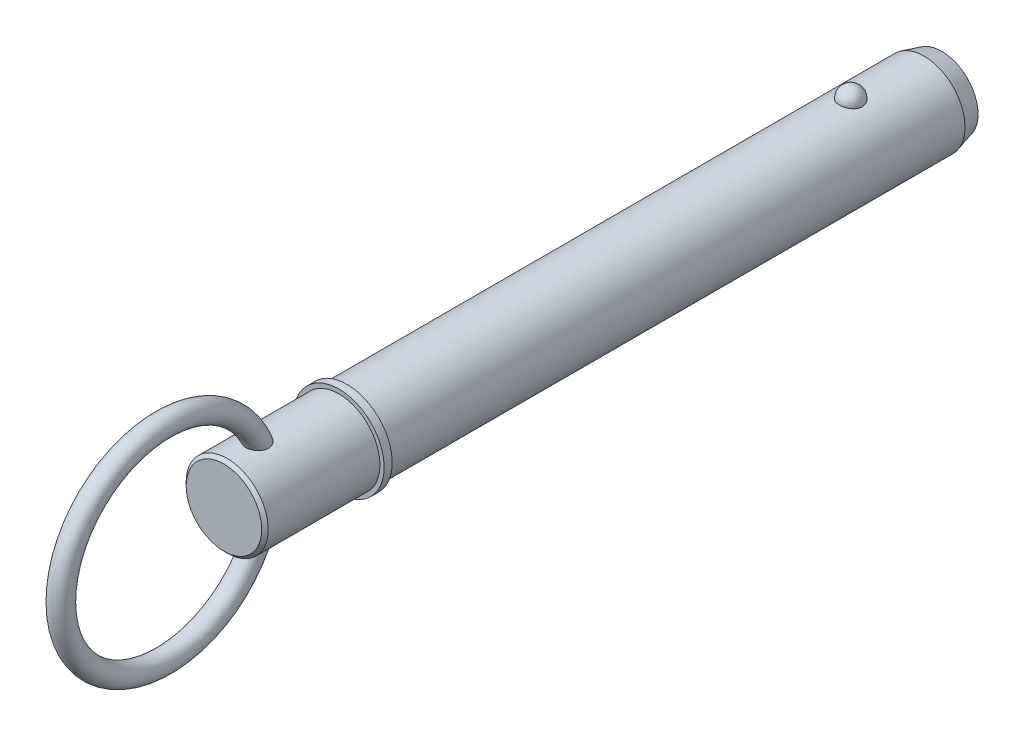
ISO-10303-21;
HEADER;
FILE_DESCRIPTION(('STEP AP214'),'2;1');
FILE_NAME('part.step','',(''),(''),'','','');
FILE_SCHEMA(('AUTOMOTIVE_DESIGN { 1 0 10303 214 1 1 1 1 }'));
ENDSEC;
DATA;
#1=APPLICATION_CONTEXT('core data for automotive mechanical design processes');
#2=APPLICATION_PROTOCOL_DEFINITION('international standard','automotive_design',2000,#1);
#3=PRODUCT_CONTEXT('',#1,'mechanical');
#4=PRODUCT('Part','Part','',(#3));
#5=PRODUCT_RELATED_PRODUCT_CATEGORY('part','',(#4));
#6=PRODUCT_DEFINITION_FORMATION('','',#4);
#7=PRODUCT_DEFINITION_CONTEXT('part definition',#1,'design');
#8=PRODUCT_DEFINITION('design','',#6,#7);
#9=PRODUCT_DEFINITION_SHAPE('','',#8);
#10=(LENGTH_UNIT() NAMED_UNIT(*) SI_UNIT(.MILLI.,.METRE.));
#11=(NAMED_UNIT(*) PLANE_ANGLE_UNIT() SI_UNIT($,.RADIAN.));
#12=(NAMED_UNIT(*) SI_UNIT($,.STERADIAN.) SOLID_ANGLE_UNIT());
#13=UNCERTAINTY_MEASURE_WITH_UNIT(LENGTH_MEASURE(1.E-05),#10,'distance_accuracy_value','');
#14=(GEOMETRIC_REPRESENTATION_CONTEXT(3) GLOBAL_UNCERTAINTY_ASSIGNED_CONTEXT((#13)) GLOBAL_UNIT_ASSIGNED_CONTEXT((#10,
#11,#12)) REPRESENTATION_CONTEXT('',''));
#15=CARTESIAN_POINT('',(0.,0.,0.));
#16=DIRECTION('',(0.,0.,1.));
#17=DIRECTION('',(1.,0.,0.));
#18=AXIS2_PLACEMENT_3D('',#15,#16,#17);
#19=CARTESIAN_POINT('',(0.,0.,152.4));
#20=DIRECTION('',(0.,0.,-1.));
#21=DIRECTION('',(-1.,0.,0.));
#22=AXIS2_PLACEMENT_3D('',#19,#20,#21);
#23=CYLINDRICAL_SURFACE('',#22,12.7);
#24=CARTESIAN_POINT('',(3.52486003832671,12.2010393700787,-3.56));
#25=CARTESIAN_POINT('',(3.52485671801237,12.2010422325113,-3.3610062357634));
#26=CARTESIAN_POINT('',(3.50863187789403,12.2057632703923,-3.16197042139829));
#27=CARTESIAN_POINT('',(3.4441205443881,12.2241207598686,-2.76953945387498));
#28=CARTESIAN_POINT('',(3.39582213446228,12.2377605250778,-2.57614642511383));
#29=CARTESIAN_POINT('',(3.26839193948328,12.2724057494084,-2.20059799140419));
#30=CARTESIAN_POINT('',(3.18927369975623,12.2934079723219,-2.01843769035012));
#31=CARTESIAN_POINT('',(3.00217139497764,12.3404306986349,-1.6703228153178));
#32=CARTESIAN_POINT('',(2.89418796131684,12.3664510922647,-1.50436788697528));
#33=CARTESIAN_POINT('',(2.65144862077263,12.4207616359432,-1.19241975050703));
#34=CARTESIAN_POINT('',(2.51656310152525,12.4490623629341,-1.04652919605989));
#35=CARTESIAN_POINT('',(2.22383249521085,12.5046678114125,-0.7797110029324));
#36=CARTESIAN_POINT('',(2.0659873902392,12.5319725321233,-0.658783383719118));
#37=CARTESIAN_POINT('',(1.73204520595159,12.5824645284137,-0.445586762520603));
#38=CARTESIAN_POINT('',(1.55600183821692,12.6056634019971,-0.353236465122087));
#39=CARTESIAN_POINT('',(1.19021695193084,12.6454411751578,-0.199381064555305));
#40=CARTESIAN_POINT('',(1.00047694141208,12.6620208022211,-0.137872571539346));
#41=CARTESIAN_POINT('',(0.616329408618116,12.6864692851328,-0.0483191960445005));
#42=CARTESIAN_POINT('',(0.422067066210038,12.6944893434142,-0.0196927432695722));
#43=CARTESIAN_POINT('',(0.031325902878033,12.7014637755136,0.00524116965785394));
#44=CARTESIAN_POINT('',(-0.165152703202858,12.7004190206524,0.00155173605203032));
#45=CARTESIAN_POINT('',(-0.551780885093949,12.6894611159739,-0.0377454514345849));
#46=CARTESIAN_POINT('',(-0.741980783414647,12.6796749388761,-0.0728962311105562));
#47=CARTESIAN_POINT('',(-1.11361063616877,12.6524544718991,-0.173489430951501));
#48=CARTESIAN_POINT('',(-1.29504043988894,12.6350200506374,-0.238932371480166));
#49=CARTESIAN_POINT('',(-1.64521311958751,12.5942270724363,-0.398772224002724));
#50=CARTESIAN_POINT('',(-1.81387645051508,12.5708347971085,-0.493334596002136));
#51=CARTESIAN_POINT('',(-2.13292959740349,12.5206522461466,-0.708731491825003));
#52=CARTESIAN_POINT('',(-2.28331755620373,12.4938616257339,-0.829568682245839));
#53=CARTESIAN_POINT('',(-2.56470285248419,12.4391828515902,-1.09687144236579));
#54=CARTESIAN_POINT('',(-2.69527522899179,12.4112835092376,-1.24378221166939));
#55=CARTESIAN_POINT('',(-2.93023079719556,12.3579248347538,-1.55763192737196));
#56=CARTESIAN_POINT('',(-3.03461212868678,12.3324656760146,-1.72457229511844));
#57=CARTESIAN_POINT('',(-3.21564423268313,12.2865167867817,-2.07598316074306));
#58=CARTESIAN_POINT('',(-3.29196222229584,12.2660875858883,-2.26063321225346));
#59=CARTESIAN_POINT('',(-3.41323771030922,12.2328979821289,-2.64061334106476));
#60=CARTESIAN_POINT('',(-3.45819611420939,12.2201373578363,-2.83594310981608));
#61=CARTESIAN_POINT('',(-3.51550038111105,12.2037762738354,-3.2308649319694));
#62=CARTESIAN_POINT('',(-3.5279827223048,12.200137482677,-3.43043558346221));
#63=CARTESIAN_POINT('',(-3.52041430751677,12.2023234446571,-3.82890252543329));
#64=CARTESIAN_POINT('',(-3.50036443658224,12.2081479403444,-4.02779883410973));
#65=CARTESIAN_POINT('',(-3.42842010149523,12.2285446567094,-4.41824213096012));
#66=CARTESIAN_POINT('',(-3.37668525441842,12.243073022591,-4.6098208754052));
#67=CARTESIAN_POINT('',(-3.24279085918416,12.2792134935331,-4.98132360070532));
#68=CARTESIAN_POINT('',(-3.16063009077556,12.300825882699,-5.16124711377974));
#69=CARTESIAN_POINT('',(-2.96738224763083,12.3488691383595,-5.5054285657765));
#70=CARTESIAN_POINT('',(-2.85613997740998,12.3753256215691,-5.66959579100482));
#71=CARTESIAN_POINT('',(-2.60773241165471,12.4300386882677,-5.97665065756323));
#72=CARTESIAN_POINT('',(-2.47056612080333,12.458295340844,-6.11953748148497));
#73=CARTESIAN_POINT('',(-2.17327999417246,12.5135827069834,-6.38059312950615));
#74=CARTESIAN_POINT('',(-2.01307652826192,12.5406084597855,-6.49866785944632));
#75=CARTESIAN_POINT('',(-1.67442544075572,12.5902954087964,-6.70609314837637));
#76=CARTESIAN_POINT('',(-1.49597909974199,12.6129569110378,-6.7954457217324));
#77=CARTESIAN_POINT('',(-1.12819666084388,12.6511224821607,-6.94192787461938));
#78=CARTESIAN_POINT('',(-0.939024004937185,12.666712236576,-6.99944518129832));
#79=CARTESIAN_POINT('',(-0.553267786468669,12.6894125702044,-7.08227444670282));
#80=CARTESIAN_POINT('',(-0.35668512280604,12.6965241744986,-7.10759029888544));
#81=CARTESIAN_POINT('',(0.0343320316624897,12.7014305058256,-7.12510946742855));
#82=CARTESIAN_POINT('',(0.228736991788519,12.6993986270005,-7.11792901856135));
#83=CARTESIAN_POINT('',(0.613493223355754,12.6866339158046,-7.07206766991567));
#84=CARTESIAN_POINT('',(0.803844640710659,12.6759013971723,-7.03338790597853));
#85=CARTESIAN_POINT('',(1.1744074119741,12.6469443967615,-6.925834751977));
#86=CARTESIAN_POINT('',(1.35465462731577,12.6287486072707,-6.85707692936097));
#87=CARTESIAN_POINT('',(1.7009252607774,12.5867908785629,-6.69128257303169));
#88=CARTESIAN_POINT('',(1.86694777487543,12.5630285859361,-6.59424424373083));
#89=CARTESIAN_POINT('',(2.18289085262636,12.5120350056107,-6.3727748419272));
#90=CARTESIAN_POINT('',(2.33252391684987,12.4847559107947,-6.24794475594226));
#91=CARTESIAN_POINT('',(2.60889724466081,12.4299457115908,-5.97511730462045));
#92=CARTESIAN_POINT('',(2.73563353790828,12.4024145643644,-5.82711592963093));
#93=CARTESIAN_POINT('',(2.96505559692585,12.3495984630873,-5.50912267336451));
#94=CARTESIAN_POINT('',(3.06728335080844,12.3243610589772,-5.33879227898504));
#95=CARTESIAN_POINT('',(3.24218794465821,12.2795120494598,-4.98295005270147));
#96=CARTESIAN_POINT('',(3.31487538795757,12.2598984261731,-4.79744369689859));
#97=CARTESIAN_POINT('',(3.42255689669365,12.2302435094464,-4.43775244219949));
#98=CARTESIAN_POINT('',(3.46085292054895,12.2193780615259,-4.264615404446));
#99=CARTESIAN_POINT('',(3.5120056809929,12.2047747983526,-3.9143299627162));
#100=CARTESIAN_POINT('',(3.52486299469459,12.2010368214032,-3.73718164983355));
#101=CARTESIAN_POINT('',(3.52486003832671,12.2010393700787,-3.56));
#102=B_SPLINE_CURVE_WITH_KNOTS('',3,(#24,#25,#26,#27,#28,#29,#30,#31,#32,#33,#34,#35,#36,#37,
#38,#39,#40,#41,#42,#43,#44,#45,#46,#47,#48,#49,#50,#51,#52,#53,#54,#55,#56,#57,#58,#59,#60,#61,
#62,#63,#64,#65,#66,#67,#68,#69,#70,#71,#72,#73,#74,#75,#76,#77,#78,#79,#80,#81,#82,#83,#84,#85,
#86,#87,#88,#89,#90,#91,#92,#93,#94,#95,#96,#97,#98,#99,#100,#101),.UNSPECIFIED.,.T.,.F.,(4,2,2,
2,2,2,2,2,2,2,2,2,2,2,2,2,2,2,2,2,2,2,2,2,2,2,2,2,2,2,2,2,2,2,2,2,2,2,4),(0.,0.596344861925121,
1.19291141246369,1.78921606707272,2.38550767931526,2.98474477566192,3.58398233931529,
4.18149920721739,4.77895038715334,5.36566361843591,5.95232045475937,6.53059198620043,
7.10887345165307,7.6905033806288,8.27219236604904,8.86498552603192,9.45782077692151,
10.0574751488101,10.6571122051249,11.2542252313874,11.8513220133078,12.4454353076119,
13.0395724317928,13.636947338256,14.2343451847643,14.8339691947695,15.4335511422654,
16.0256602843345,16.6176978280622,17.1985559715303,17.7793931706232,18.3580179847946,
18.9366795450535,19.5242567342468,20.1119357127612,20.7098642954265,21.3075780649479,
21.8385683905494,22.3695466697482),.UNSPECIFIED.);
#103=CARTESIAN_POINT('',(3.52486003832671,12.2010393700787,-3.56));
#104=VERTEX_POINT('',#103);
#105=EDGE_CURVE('E102',#104,#104,#102,.T.);
#106=ORIENTED_EDGE('',*,*,#105,.T.);
#107=EDGE_LOOP('',(#106));
#108=FACE_BOUND('',#107,.T.);
#109=CARTESIAN_POINT('',(0.,0.,-26.2500000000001));
#110=DIRECTION('',(0.,0.,-1.));
#111=DIRECTION('',(-1.,0.,0.));
#112=AXIS2_PLACEMENT_3D('',#109,#110,#111);
#113=CIRCLE('',#112,12.7);
#114=CARTESIAN_POINT('',(-12.7,0.,-26.2500000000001));
#115=VERTEX_POINT('',#114);
#116=EDGE_CURVE('E109',#115,#115,#113,.F.);
#117=ORIENTED_EDGE('',*,*,#116,.T.);
#118=EDGE_LOOP('',(#117));
#119=FACE_BOUND('',#118,.T.);
#120=CARTESIAN_POINT('',(0.,0.,152.4));
#121=DIRECTION('',(0.,0.,1.));
#122=DIRECTION('',(1.,0.,0.));
#123=AXIS2_PLACEMENT_3D('',#120,#121,#122);
#124=CIRCLE('',#123,12.7);
#125=CARTESIAN_POINT('',(12.7,0.,152.4));
#126=VERTEX_POINT('',#125);
#127=EDGE_CURVE('E107',#126,#126,#124,.T.);
#128=ORIENTED_EDGE('',*,*,#127,.F.);
#129=EDGE_LOOP('',(#128));
#130=FACE_BOUND('',#129,.T.);
#131=ADVANCED_FACE('F39',(#108,#119,#130),#23,.T.);
#132=CARTESIAN_POINT('',(0.,0.,-31.75));
#133=DIRECTION('',(0.,0.,-1.));
#134=DIRECTION('',(-1.,0.,0.));
#135=AXIS2_PLACEMENT_3D('',#132,#133,#134);
#136=PLANE('',#135);
#137=CARTESIAN_POINT('',(0.,0.,-31.75));
#138=DIRECTION('',(0.,0.,-1.));
#139=DIRECTION('',(-1.,0.,0.));
#140=AXIS2_PLACEMENT_3D('',#137,#138,#139);
#141=CIRCLE('',#140,11.2262794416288);
#142=CARTESIAN_POINT('',(-11.2262794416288,0.,-31.75));
#143=VERTEX_POINT('',#142);
#144=EDGE_CURVE('E141',#143,#143,#141,.T.);
#145=ORIENTED_EDGE('',*,*,#144,.T.);
#146=EDGE_LOOP('',(#145));
#147=FACE_BOUND('',#146,.T.);
#148=ADVANCED_FACE('F88',(#147),#136,.T.);
#149=CARTESIAN_POINT('',(0.,0.,-31.75));
#150=DIRECTION('',(0.,0.,1.));
#151=DIRECTION('',(1.,0.,0.));
#152=AXIS2_PLACEMENT_3D('',#149,#150,#151);
#153=CONICAL_SURFACE('',#152,11.2262794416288,0.261799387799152);
#154=ORIENTED_EDGE('',*,*,#116,.F.);
#155=EDGE_LOOP('',(#154));
#156=FACE_BOUND('',#155,.T.);
#157=ORIENTED_EDGE('',*,*,#144,.F.);
#158=EDGE_LOOP('',(#157));
#159=FACE_BOUND('',#158,.T.);
#160=ADVANCED_FACE('F94',(#156,#159),#153,.T.);
#161=CARTESIAN_POINT('',(0.,12.7,-3.56));
#162=DIRECTION('',(0.,1.,0.));
#163=DIRECTION('',(0.,0.,1.));
#164=AXIS2_PLACEMENT_3D('',#161,#162,#163);
#165=SPHERICAL_SURFACE('',#164,3.56);
#166=ORIENTED_EDGE('',*,*,#105,.F.);
#167=EDGE_LOOP('',(#166));
#168=FACE_BOUND('',#167,.T.);
#169=ADVANCED_FACE('F112',(#168),#165,.T.);
#170=CARTESIAN_POINT('',(0.,0.,152.4));
#171=DIRECTION('',(0.,0.,-1.));
#172=DIRECTION('',(-1.,0.,0.));
#173=AXIS2_PLACEMENT_3D('',#170,#171,#172);
#174=PLANE('',#173);
#175=ORIENTED_EDGE('',*,*,#127,.T.);
#176=EDGE_LOOP('',(#175));
#177=FACE_BOUND('',#176,.T.);
#178=CARTESIAN_POINT('',(0.,0.,152.4));
#179=DIRECTION('',(0.,0.,-1.));
#180=DIRECTION('',(-1.,0.,0.));
#181=AXIS2_PLACEMENT_3D('',#178,#179,#180);
#182=CIRCLE('',#181,14.);
#183=CARTESIAN_POINT('',(-14.,0.,152.4));
#184=VERTEX_POINT('',#183);
#185=EDGE_CURVE('E108',#184,#184,#182,.T.);
#186=ORIENTED_EDGE('',*,*,#185,.T.);
#187=EDGE_LOOP('',(#186));
#188=FACE_BOUND('',#187,.T.);
#189=ADVANCED_FACE('F116',(#177,#188),#174,.T.);
#190=CARTESIAN_POINT('',(0.,0.,33.7287874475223));
#191=DIRECTION('',(0.,0.,-1.));
#192=DIRECTION('',(-1.,0.,0.));
#193=AXIS2_PLACEMENT_3D('',#190,#191,#192);
#194=CYLINDRICAL_SURFACE('',#193,14.);
#195=CARTESIAN_POINT('',(0.,0.,154.9));
#196=DIRECTION('',(0.,0.,-1.));
#197=DIRECTION('',(-1.,0.,0.));
#198=AXIS2_PLACEMENT_3D('',#195,#196,#197);
#199=CIRCLE('',#198,14.);
#200=CARTESIAN_POINT('',(-14.,0.,154.9));
#201=VERTEX_POINT('',#200);
#202=EDGE_CURVE('E133',#201,#201,#199,.T.);
#203=ORIENTED_EDGE('',*,*,#202,.T.);
#204=EDGE_LOOP('',(#203));
#205=FACE_BOUND('',#204,.T.);
#206=ORIENTED_EDGE('',*,*,#185,.F.);
#207=EDGE_LOOP('',(#206));
#208=FACE_BOUND('',#207,.T.);
#209=ADVANCED_FACE('F120',(#205,#208),#194,.T.);
#210=CARTESIAN_POINT('',(0.,14.,154.9));
#211=DIRECTION('',(0.,0.,1.));
#212=DIRECTION('',(1.,0.,0.));
#213=AXIS2_PLACEMENT_3D('',#210,#211,#212);
#214=PLANE('',#213);
#215=CARTESIAN_POINT('',(0.,0.,154.9));
#216=DIRECTION('',(0.,0.,1.));
#217=DIRECTION('',(1.,0.,0.));
#218=AXIS2_PLACEMENT_3D('',#215,#216,#217);
#219=CIRCLE('',#218,12.7);
#220=CARTESIAN_POINT('',(12.7,0.,154.9));
#221=VERTEX_POINT('',#220);
#222=EDGE_CURVE('E111',#221,#221,#219,.T.);
#223=ORIENTED_EDGE('',*,*,#222,.F.);
#224=EDGE_LOOP('',(#223));
#225=FACE_BOUND('',#224,.T.);
#226=ORIENTED_EDGE('',*,*,#202,.F.);
#227=EDGE_LOOP('',(#226));
#228=FACE_BOUND('',#227,.T.);
#229=ADVANCED_FACE('F85',(#225,#228),#214,.T.);
#230=CARTESIAN_POINT('',(0.,0.,190.5));
#231=DIRECTION('',(0.,0.,-1.));
#232=DIRECTION('',(-1.,0.,0.));
#233=AXIS2_PLACEMENT_3D('',#230,#231,#232);
#234=CYLINDRICAL_SURFACE('',#233,12.7);
#235=CARTESIAN_POINT('',(-1.22892607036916,-12.6404011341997,176.87119395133));
#236=CARTESIAN_POINT('',(-1.06119922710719,-12.6567092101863,176.804004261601));
#237=CARTESIAN_POINT('',(-0.887663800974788,-12.6701810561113,176.750792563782));
#238=CARTESIAN_POINT('',(-0.533823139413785,-12.6900116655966,176.673419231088));
#239=CARTESIAN_POINT('',(-0.353518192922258,-12.6963707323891,176.6492563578));
#240=CARTESIAN_POINT('',(0.0087115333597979,-12.7012887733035,176.630519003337));
#241=CARTESIAN_POINT('',(0.190636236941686,-12.699848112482,176.635943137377));
#242=CARTESIAN_POINT('',(0.5509718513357,-12.6893231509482,176.676255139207));
#243=CARTESIAN_POINT('',(0.729382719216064,-12.6802387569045,176.71114336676));
#244=CARTESIAN_POINT('',(1.0777168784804,-12.6553960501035,176.809659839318));
#245=CARTESIAN_POINT('',(1.24763507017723,-12.6396337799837,176.873305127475));
#246=CARTESIAN_POINT('',(1.57398922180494,-12.6031560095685,177.027891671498));
#247=CARTESIAN_POINT('',(1.73042571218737,-12.5824407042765,177.118831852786));
#248=CARTESIAN_POINT('',(2.02464767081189,-12.5384554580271,177.325320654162));
#249=CARTESIAN_POINT('',(2.16251370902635,-12.5151974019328,177.44075697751));
#250=CARTESIAN_POINT('',(2.41652917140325,-12.4686447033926,177.693426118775));
#251=CARTESIAN_POINT('',(2.53268123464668,-12.4453500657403,177.830656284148));
#252=CARTESIAN_POINT('',(2.73971690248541,-12.4014166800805,178.12226178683));
#253=CARTESIAN_POINT('',(2.83072997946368,-12.3807646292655,178.276543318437));
#254=CARTESIAN_POINT('',(2.98642630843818,-12.3441356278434,178.598338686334));
#255=CARTESIAN_POINT('',(3.05110876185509,-12.3281588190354,178.765852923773));
#256=CARTESIAN_POINT('',(3.15450336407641,-12.3021148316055,179.112705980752));
#257=CARTESIAN_POINT('',(3.19268116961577,-12.2921697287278,179.292212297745));
#258=CARTESIAN_POINT('',(3.24150148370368,-12.2793848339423,179.655144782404));
#259=CARTESIAN_POINT('',(3.25213515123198,-12.2765473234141,179.838572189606));
#260=CARTESIAN_POINT('',(3.24696781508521,-12.2779158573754,180.218893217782));
#261=CARTESIAN_POINT('',(3.22910261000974,-12.2826719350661,180.415753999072));
#262=CARTESIAN_POINT('',(3.16504953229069,-12.2993299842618,180.80447917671));
#263=CARTESIAN_POINT('',(3.11884966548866,-12.3112349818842,180.996341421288));
#264=CARTESIAN_POINT('',(2.99323123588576,-12.3424162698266,181.392891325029));
#265=CARTESIAN_POINT('',(2.91059577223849,-12.3623844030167,181.596505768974));
#266=CARTESIAN_POINT('',(2.71447440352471,-12.4069229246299,181.988190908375));
#267=CARTESIAN_POINT('',(2.60094970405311,-12.431499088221,182.176241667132));
#268=CARTESIAN_POINT('',(2.40499526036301,-12.4703951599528,182.447470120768));
#269=CARTESIAN_POINT('',(2.3330184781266,-12.4841083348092,182.538407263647));
#270=CARTESIAN_POINT('',(2.18106597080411,-12.5115521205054,182.713320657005));
#271=CARTESIAN_POINT('',(2.10108885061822,-12.5252827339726,182.797295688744));
#272=CARTESIAN_POINT('',(1.8497396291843,-12.5657115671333,183.036779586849));
#273=CARTESIAN_POINT('',(1.6664677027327,-12.5917488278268,183.180526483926));
#274=CARTESIAN_POINT('',(1.33551340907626,-12.6303067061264,183.385856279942));
#275=CARTESIAN_POINT('',(1.19512135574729,-12.6444898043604,183.45902243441));
#276=CARTESIAN_POINT('',(0.903945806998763,-12.6686276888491,183.581586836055));
#277=CARTESIAN_POINT('',(0.753173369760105,-12.6785868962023,183.631009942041));
#278=CARTESIAN_POINT('',(0.444090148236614,-12.6931800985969,183.702942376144));
#279=CARTESIAN_POINT('',(0.285741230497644,-12.6977833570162,183.725296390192));
#280=CARTESIAN_POINT('',(-0.03244918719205,-12.700953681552,183.740724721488));
#281=CARTESIAN_POINT('',(-0.19229038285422,-12.6995219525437,183.733804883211));
#282=CARTESIAN_POINT('',(-0.493822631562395,-12.6912132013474,183.693209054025));
#283=CARTESIAN_POINT('',(-0.635865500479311,-12.6848307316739,183.661962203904));
#284=CARTESIAN_POINT('',(-0.913041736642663,-12.6678986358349,183.577721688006));
#285=CARTESIAN_POINT('',(-1.04817349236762,-12.6573480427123,183.524722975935));
#286=CARTESIAN_POINT('',(-1.31637898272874,-12.6323524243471,183.396233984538));
#287=CARTESIAN_POINT('',(-1.44890088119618,-12.6177203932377,183.319638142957));
#288=CARTESIAN_POINT('',(-1.70162176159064,-12.5861326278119,183.148743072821));
#289=CARTESIAN_POINT('',(-1.82181486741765,-12.569175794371,183.054435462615));
#290=CARTESIAN_POINT('',(-2.06961284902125,-12.5309682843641,182.832665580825));
#291=CARTESIAN_POINT('',(-2.19457628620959,-12.5094982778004,182.70229330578));
#292=CARTESIAN_POINT('',(-2.42503767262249,-12.4668738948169,182.425308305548));
#293=CARTESIAN_POINT('',(-2.53052086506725,-12.4457197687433,182.278683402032));
#294=CARTESIAN_POINT('',(-2.73961150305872,-12.4015349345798,181.943065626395));
#295=CARTESIAN_POINT('',(-2.83895917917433,-12.3789253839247,181.751346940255));
#296=CARTESIAN_POINT('',(-3.00725804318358,-12.3391195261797,181.354405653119));
#297=CARTESIAN_POINT('',(-3.0761885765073,-12.3219268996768,181.149173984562));
#298=CARTESIAN_POINT('',(-3.18528660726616,-12.2942052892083,180.713754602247));
#299=CARTESIAN_POINT('',(-3.22287145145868,-12.2842816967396,180.482855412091));
#300=CARTESIAN_POINT('',(-3.24821271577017,-12.2775854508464,180.134351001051));
#301=CARTESIAN_POINT('',(-3.25148236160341,-12.276719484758,180.017777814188));
#302=CARTESIAN_POINT('',(-3.24729041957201,-12.2778310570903,179.784859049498));
#303=CARTESIAN_POINT('',(-3.23983534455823,-12.2798068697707,179.668513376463));
#304=CARTESIAN_POINT('',(-3.21488959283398,-12.286359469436,179.44622762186));
#305=CARTESIAN_POINT('',(-3.19823165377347,-12.2907201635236,179.340186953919));
#306=CARTESIAN_POINT('',(-3.15537465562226,-12.3017926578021,179.13022257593));
#307=CARTESIAN_POINT('',(-3.12918076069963,-12.3085031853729,179.026297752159));
#308=CARTESIAN_POINT('',(-3.06721568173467,-12.3240904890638,178.821553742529));
#309=CARTESIAN_POINT('',(-3.0314485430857,-12.3329663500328,178.720733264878));
#310=CARTESIAN_POINT('',(-2.95042598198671,-12.3525998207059,178.523171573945));
#311=CARTESIAN_POINT('',(-2.90517160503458,-12.3633572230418,178.426429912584));
#312=CARTESIAN_POINT('',(-2.81116315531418,-12.3850478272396,178.248857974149));
#313=CARTESIAN_POINT('',(-2.76340897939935,-12.3958187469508,178.167476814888));
#314=CARTESIAN_POINT('',(-2.66091958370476,-12.4182228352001,178.009317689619));
#315=CARTESIAN_POINT('',(-2.60618212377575,-12.4298562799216,177.932541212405));
#316=CARTESIAN_POINT('',(-2.4901313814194,-12.4536239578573,177.784278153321));
#317=CARTESIAN_POINT('',(-2.42882150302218,-12.4657579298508,177.712788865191));
#318=CARTESIAN_POINT('',(-2.30002146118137,-12.4901640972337,177.575587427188));
#319=CARTESIAN_POINT('',(-2.23252894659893,-12.5024363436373,177.509877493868));
#320=CARTESIAN_POINT('',(-2.09370795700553,-12.5264205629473,177.386377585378));
#321=CARTESIAN_POINT('',(-2.02252382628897,-12.5381388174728,177.328426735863));
#322=CARTESIAN_POINT('',(-1.87531735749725,-12.5610012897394,177.21889123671));
#323=CARTESIAN_POINT('',(-1.79929316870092,-12.5721452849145,177.167309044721));
#324=CARTESIAN_POINT('',(-1.56485282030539,-12.6042047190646,177.022706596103));
#325=CARTESIAN_POINT('',(-1.39990754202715,-12.6237766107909,176.939687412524));
#326=CARTESIAN_POINT('',(-1.22892607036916,-12.6404011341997,176.87119395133));
#327=B_SPLINE_CURVE_WITH_KNOTS('',3,(#235,#236,#237,#238,#239,#240,#241,#242,#243,#244,#245,
#246,#247,#248,#249,#250,#251,#252,#253,#254,#255,#256,#257,#258,#259,#260,#261,#262,#263,#264,
#265,#266,#267,#268,#269,#270,#271,#272,#273,#274,#275,#276,#277,#278,#279,#280,#281,#282,#283,
#284,#285,#286,#287,#288,#289,#290,#291,#292,#293,#294,#295,#296,#297,#298,#299,#300,#301,#302,
#303,#304,#305,#306,#307,#308,#309,#310,#311,#312,#313,#314,#315,#316,#317,#318,#319,#320,#321,
#322,#323,#324,#325,#326),.UNSPECIFIED.,.T.,.F.,(4,2,2,2,2,2,2,2,2,2,2,2,2,2,2,2,2,2,2,2,2,2,2,
2,2,2,2,2,2,2,2,2,2,2,2,2,2,2,2,2,2,2,2,2,2,4),(0.,0.543509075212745,1.08699497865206,
1.63045544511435,2.17392254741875,2.71771216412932,3.26148037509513,3.80280767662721,
4.34406914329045,4.88248866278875,5.42092451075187,5.9699227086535,6.51909710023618,
7.10988630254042,7.70092576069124,8.3601374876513,9.02018098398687,9.37009147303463,
9.72006308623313,10.4175255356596,10.8925536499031,11.3670833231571,11.844322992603,
12.3214673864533,12.7562647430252,13.1911630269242,13.6507378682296,14.110530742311,
14.6541210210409,15.198121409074,15.8467121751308,16.4957426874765,17.1940750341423,
17.5435132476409,17.8927393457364,18.2145822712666,18.536251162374,18.8577843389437,
19.1792821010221,19.4638320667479,19.7484735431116,20.0329683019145,20.3175717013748,
20.5948148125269,20.8721645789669,21.4262200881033),.UNSPECIFIED.);
#328=CARTESIAN_POINT('',(-1.22892607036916,-12.6404011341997,176.87119395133));
#329=VERTEX_POINT('',#328);
#330=EDGE_CURVE('E10',#329,#329,#327,.T.);
#331=ORIENTED_EDGE('',*,*,#330,.F.);
#332=EDGE_LOOP('',(#331));
#333=FACE_BOUND('',#332,.T.);
#334=CARTESIAN_POINT('',(-1.22892607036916,12.6404011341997,176.87119395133));
#335=CARTESIAN_POINT('',(-1.39512541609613,12.624240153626,176.93776712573));
#336=CARTESIAN_POINT('',(-1.55582432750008,12.6052778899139,177.018153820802));
#337=CARTESIAN_POINT('',(-1.86136954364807,12.5638060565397,177.204658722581));
#338=CARTESIAN_POINT('',(-2.00617769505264,12.5412882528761,177.310836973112));
#339=CARTESIAN_POINT('',(-2.27547906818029,12.4952333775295,177.546103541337));
#340=CARTESIAN_POINT('',(-2.3999874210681,12.4716970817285,177.675174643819));
#341=CARTESIAN_POINT('',(-2.62534229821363,12.4262157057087,177.952623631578));
#342=CARTESIAN_POINT('',(-2.72620384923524,12.4042696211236,178.100989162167));
#343=CARTESIAN_POINT('',(-2.90197976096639,12.3643304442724,178.4126750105));
#344=CARTESIAN_POINT('',(-2.97691335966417,12.346334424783,178.575984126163));
#345=CARTESIAN_POINT('',(-3.09983588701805,12.3160482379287,178.912927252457));
#346=CARTESIAN_POINT('',(-3.14781852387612,12.3037594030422,179.086563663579));
#347=CARTESIAN_POINT('',(-3.21809353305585,12.2855709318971,179.445523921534));
#348=CARTESIAN_POINT('',(-3.23943500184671,12.2799082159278,179.631044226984));
#349=CARTESIAN_POINT('',(-3.2544382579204,12.2759385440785,180.003232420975));
#350=CARTESIAN_POINT('',(-3.24809142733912,12.2776338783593,180.189900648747));
#351=CARTESIAN_POINT('',(-3.20755159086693,12.288291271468,180.577577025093));
#352=CARTESIAN_POINT('',(-3.17081691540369,12.2979162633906,180.778299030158));
#353=CARTESIAN_POINT('',(-3.06845850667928,12.3238513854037,181.171858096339));
#354=CARTESIAN_POINT('',(-3.00281105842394,12.3401670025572,181.364688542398));
#355=CARTESIAN_POINT('',(-2.83560995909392,12.3797223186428,181.759473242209));
#356=CARTESIAN_POINT('',(-2.73085133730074,12.4035339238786,181.960019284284));
#357=CARTESIAN_POINT('',(-2.48976141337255,12.4541651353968,182.340813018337));
#358=CARTESIAN_POINT('',(-2.35343772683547,12.4809840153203,182.521065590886));
#359=CARTESIAN_POINT('',(-2.07683984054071,12.5296806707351,182.82565995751));
#360=CARTESIAN_POINT('',(-1.94129351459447,12.551613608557,182.954283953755));
#361=CARTESIAN_POINT('',(-1.65081707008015,12.5931023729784,183.187836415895));
#362=CARTESIAN_POINT('',(-1.49591505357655,12.6126615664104,183.292798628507));
#363=CARTESIAN_POINT('',(-1.19690065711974,12.6442092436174,183.457788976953));
#364=CARTESIAN_POINT('',(-1.0554126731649,12.6569190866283,183.522418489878));
#365=CARTESIAN_POINT('',(-0.76341583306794,12.6778764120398,183.627638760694));
#366=CARTESIAN_POINT('',(-0.612913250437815,12.6861269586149,183.668246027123));
#367=CARTESIAN_POINT('',(-0.306168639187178,12.697239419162,183.722715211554));
#368=CARTESIAN_POINT('',(-0.149903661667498,12.7000767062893,183.736454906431));
#369=CARTESIAN_POINT('',(0.16255262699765,12.699920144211,183.73569423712));
#370=CARTESIAN_POINT('',(0.318743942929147,12.6969267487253,183.721196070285));
#371=CARTESIAN_POINT('',(0.614555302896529,12.6859231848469,183.667234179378));
#372=CARTESIAN_POINT('',(0.754548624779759,12.6782987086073,183.629687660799));
#373=CARTESIAN_POINT('',(1.0268504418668,12.6591561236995,183.533711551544));
#374=CARTESIAN_POINT('',(1.15915690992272,12.6476369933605,183.475276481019));
#375=CARTESIAN_POINT('',(1.42405861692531,12.6206654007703,183.334988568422));
#376=CARTESIAN_POINT('',(1.5558287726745,12.604971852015,183.251635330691));
#377=CARTESIAN_POINT('',(1.80621935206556,12.571537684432,183.067498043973));
#378=CARTESIAN_POINT('',(1.92483289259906,12.5537960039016,182.966704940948));
#379=CARTESIAN_POINT('',(2.16936918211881,12.5140714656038,182.730174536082));
#380=CARTESIAN_POINT('',(2.29236422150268,12.4919255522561,182.591439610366));
#381=CARTESIAN_POINT('',(2.5176248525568,12.4484835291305,182.297913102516));
#382=CARTESIAN_POINT('',(2.61987416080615,12.4271880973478,182.143109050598));
#383=CARTESIAN_POINT('',(2.81956306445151,12.3835520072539,181.791316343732));
#384=CARTESIAN_POINT('',(2.91268031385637,12.3617361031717,181.591798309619));
#385=CARTESIAN_POINT('',(3.06675738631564,12.3244204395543,181.179898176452));
#386=CARTESIAN_POINT('',(3.12769905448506,12.3089242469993,180.967508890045));
#387=CARTESIAN_POINT('',(3.19410612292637,12.2917937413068,180.637729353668));
#388=CARTESIAN_POINT('',(3.21217746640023,12.2870696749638,180.522917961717));
#389=CARTESIAN_POINT('',(3.23822570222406,12.2802317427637,180.292095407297));
#390=CARTESIAN_POINT('',(3.24620727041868,12.2781166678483,180.17608482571));
#391=CARTESIAN_POINT('',(3.25166839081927,12.2766712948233,179.94381042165));
#392=CARTESIAN_POINT('',(3.24914931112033,12.2773406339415,179.827546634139));
#393=CARTESIAN_POINT('',(3.23325304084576,12.2815367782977,179.595869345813));
#394=CARTESIAN_POINT('',(3.2198826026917,12.2850618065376,179.48045536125));
#395=CARTESIAN_POINT('',(3.18378347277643,12.2944635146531,179.262188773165));
#396=CARTESIAN_POINT('',(3.16203615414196,12.3000921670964,179.159162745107));
#397=CARTESIAN_POINT('',(3.10931056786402,12.3135262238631,178.955694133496));
#398=CARTESIAN_POINT('',(3.0783372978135,12.3213304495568,178.85525018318));
#399=CARTESIAN_POINT('',(3.00719503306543,12.3388864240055,178.657882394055));
#400=CARTESIAN_POINT('',(2.96702904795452,12.34863753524,178.560957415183));
#401=CARTESIAN_POINT('',(2.87766260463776,12.3697681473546,178.37155308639));
#402=CARTESIAN_POINT('',(2.82846300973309,12.3811474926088,178.279073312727));
#403=CARTESIAN_POINT('',(2.72718770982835,12.4038233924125,178.109278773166));
#404=CARTESIAN_POINT('',(2.67601025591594,12.4149937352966,178.031409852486));
#405=CARTESIAN_POINT('',(2.56702778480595,12.4379850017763,177.880514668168));
#406=CARTESIAN_POINT('',(2.50922051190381,12.4498061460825,177.807490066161));
#407=CARTESIAN_POINT('',(2.3874143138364,12.4737362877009,177.666915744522));
#408=CARTESIAN_POINT('',(2.32341881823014,12.4858451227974,177.599363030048));
#409=CARTESIAN_POINT('',(2.18967865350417,12.5099935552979,177.470183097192));
#410=CARTESIAN_POINT('',(2.11993188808,12.5220331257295,177.408558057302));
#411=CARTESIAN_POINT('',(1.90863625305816,12.5565453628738,177.237971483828));
#412=CARTESIAN_POINT('',(1.75996750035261,12.5784460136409,177.137508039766));
#413=CARTESIAN_POINT('',(1.44761854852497,12.6182083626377,176.962748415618));
#414=CARTESIAN_POINT('',(1.28394037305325,12.6360706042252,176.888448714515));
#415=CARTESIAN_POINT('',(0.945887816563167,12.6658634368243,176.767537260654));
#416=CARTESIAN_POINT('',(0.771499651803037,12.6777861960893,176.720962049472));
#417=CARTESIAN_POINT('',(0.417041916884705,12.694390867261,176.656673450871));
#418=CARTESIAN_POINT('',(0.236969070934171,12.6990685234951,176.638977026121));
#419=CARTESIAN_POINT('',(-0.124879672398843,12.7006841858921,176.632829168));
#420=CARTESIAN_POINT('',(-0.306658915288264,12.6975703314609,176.644573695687));
#421=CARTESIAN_POINT('',(-0.665297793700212,12.6838264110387,176.697473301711));
#422=CARTESIAN_POINT('',(-0.842168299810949,12.6732146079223,176.738556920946));
#423=CARTESIAN_POINT('',(-1.0502551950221,12.6565519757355,176.805394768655));
#424=CARTESIAN_POINT('',(-1.08632235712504,12.6535053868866,176.817681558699));
#425=CARTESIAN_POINT('',(-1.15798463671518,12.6471484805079,176.843501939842));
#426=CARTESIAN_POINT('',(-1.19357974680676,12.643838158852,176.85703555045));
#427=CARTESIAN_POINT('',(-1.22892607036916,12.6404011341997,176.87119395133));
#428=B_SPLINE_CURVE_WITH_KNOTS('',3,(#334,#335,#336,#337,#338,#339,#340,#341,#342,#343,#344,
#345,#346,#347,#348,#349,#350,#351,#352,#353,#354,#355,#356,#357,#358,#359,#360,#361,#362,#363,
#364,#365,#366,#367,#368,#369,#370,#371,#372,#373,#374,#375,#376,#377,#378,#379,#380,#381,#382,
#383,#384,#385,#386,#387,#388,#389,#390,#391,#392,#393,#394,#395,#396,#397,#398,#399,#400,#401,
#402,#403,#404,#405,#406,#407,#408,#409,#410,#411,#412,#413,#414,#415,#416,#417,#418,#419,#420,
#421,#422,#423,#424,#425,#426,#427),.UNSPECIFIED.,.T.,.F.,(4,2,2,2,2,2,2,2,2,2,2,2,2,2,2,2,2,2,
2,2,2,2,2,2,2,2,2,2,2,2,2,2,2,2,2,2,2,2,2,2,2,2,2,2,2,2,4),(0.,0.539146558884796,
1.07956050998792,1.6195697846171,2.15923496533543,2.69849886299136,3.23788860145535,
3.79602631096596,4.3543377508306,4.96471598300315,5.57559579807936,6.2550948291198,
6.93443009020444,7.4967142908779,8.05819140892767,8.52445959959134,8.99040698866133,
9.45846913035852,9.92649485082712,10.3600530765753,10.7937251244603,11.2621204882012,
11.7307597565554,12.2888675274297,12.8474116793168,13.5084064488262,14.1697737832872,
14.5183408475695,14.8667463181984,15.2151063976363,15.5632498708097,15.8791508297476,
16.1948809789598,16.5105079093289,16.826104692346,17.1072964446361,17.3885841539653,
17.669716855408,17.9509524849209,18.4904482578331,19.0298713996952,19.5700039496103,
20.1104536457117,20.6545101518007,21.1972460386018,21.3119068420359,21.4265694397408),.UNSPECIFIED.);
#429=CARTESIAN_POINT('',(-1.22892607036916,12.6404011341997,176.87119395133));
#430=VERTEX_POINT('',#429);
#431=EDGE_CURVE('E51',#430,#430,#428,.T.);
#432=ORIENTED_EDGE('',*,*,#431,.F.);
#433=EDGE_LOOP('',(#432));
#434=FACE_BOUND('',#433,.T.);
#435=CARTESIAN_POINT('',(0.,0.,189.5));
#436=DIRECTION('',(0.,0.,-1.));
#437=DIRECTION('',(-1.,0.,0.));
#438=AXIS2_PLACEMENT_3D('',#435,#436,#437);
#439=CIRCLE('',#438,12.7);
#440=CARTESIAN_POINT('',(-12.7,0.,189.5));
#441=VERTEX_POINT('',#440);
#442=EDGE_CURVE('E64',#441,#441,#439,.T.);
#443=ORIENTED_EDGE('',*,*,#442,.T.);
#444=EDGE_LOOP('',(#443));
#445=FACE_BOUND('',#444,.T.);
#446=ORIENTED_EDGE('',*,*,#222,.T.);
#447=EDGE_LOOP('',(#446));
#448=FACE_BOUND('',#447,.T.);
#449=ADVANCED_FACE('F69',(#333,#434,#445,#448),#234,.T.);
#450=CARTESIAN_POINT('',(0.,0.,190.5));
#451=DIRECTION('',(0.,0.,-1.));
#452=DIRECTION('',(-1.,0.,0.));
#453=AXIS2_PLACEMENT_3D('',#450,#451,#452);
#454=PLANE('',#453);
#455=CARTESIAN_POINT('',(0.,0.,190.5));
#456=DIRECTION('',(0.,0.,-1.));
#457=DIRECTION('',(-1.,0.,0.));
#458=AXIS2_PLACEMENT_3D('',#455,#456,#457);
#459=CIRCLE('',#458,11.6999999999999);
#460=CARTESIAN_POINT('',(-11.6999999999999,0.,190.5));
#461=VERTEX_POINT('',#460);
#462=EDGE_CURVE('E58',#461,#461,#459,.F.);
#463=ORIENTED_EDGE('',*,*,#462,.T.);
#464=EDGE_LOOP('',(#463));
#465=FACE_BOUND('',#464,.T.);
#466=ADVANCED_FACE('F76',(#465),#454,.F.);
#467=CARTESIAN_POINT('',(0.,0.,189.5));
#468=DIRECTION('',(0.,0.,-1.));
#469=DIRECTION('',(-1.,0.,0.));
#470=AXIS2_PLACEMENT_3D('',#467,#468,#469);
#471=CONICAL_SURFACE('',#470,12.7,0.785398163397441);
#472=ORIENTED_EDGE('',*,*,#462,.F.);
#473=EDGE_LOOP('',(#472));
#474=FACE_BOUND('',#473,.T.);
#475=ORIENTED_EDGE('',*,*,#442,.F.);
#476=EDGE_LOOP('',(#475));
#477=FACE_BOUND('',#476,.T.);
#478=ADVANCED_FACE('F41',(#474,#477),#471,.T.);
#479=CARTESIAN_POINT('',(0.,0.,209.25));
#480=DIRECTION('',(1.,0.,0.));
#481=DIRECTION('',(0.,0.,-1.));
#482=AXIS2_PLACEMENT_3D('',#479,#480,#481);
#483=TOROIDAL_SURFACE('',#482,31.75,3.25);
#484=ORIENTED_EDGE('',*,*,#330,.T.);
#485=EDGE_LOOP('',(#484));
#486=FACE_BOUND('',#485,.T.);
#487=ORIENTED_EDGE('',*,*,#431,.T.);
#488=EDGE_LOOP('',(#487));
#489=FACE_BOUND('',#488,.T.);
#490=ADVANCED_FACE('F73',(#486,#489),#483,.T.);
#491=CLOSED_SHELL('',(#131,#148,#160,#169,#189,#209,#229,#449,#466,#478,#490));
#492=MANIFOLD_SOLID_BREP('B2',#491);
#493=ADVANCED_BREP_SHAPE_REPRESENTATION('',(#18,#492),#14);
#494=SHAPE_DEFINITION_REPRESENTATION(#9,#493);
ENDSEC;
END-ISO-10303-21;
